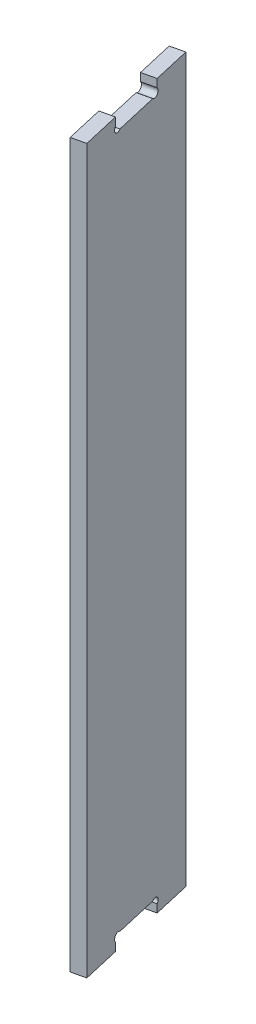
from build123d import *

# Parameters (mm, degrees)
SALIENTE_EXTRUIR1_DEPTH = 500
CROQUIS3_W              = 27.5
CROQUIS3_H              = 10
SALIENTE_EXTRUIR3_DEPTH = 10
CROQUIS4_R              = 3
CORTAR_EXTRUIR1_DEPTH   = 534.172633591


with BuildPart() as part:
    # Croquis2 → Saliente-Extruir1 (new body)
    with BuildSketch(Plane(origin=(0, 0, 0), x_dir=(1, 0, 0), z_dir=(0, 1, 0))):
        Polygon((390, 0), (411.361653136, -92.567163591), (401.617741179, -94.815758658), (380.256088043, -2.248595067), align=None)
    extrude(amount=SALIENTE_EXTRUIR1_DEPTH)

    # Croquis3 → Saliente-Extruir3 (add)
    with BuildSketch(Plane(origin=(360.536986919, 0, -83.200843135), x_dir=(0.22485950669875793, 0, 0.97439119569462), z_dir=(-0.97439119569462, 0, 0.22485950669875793))):
        with Locations((168.945207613, -5)):
            Rectangle(CROQUIS3_W, CROQUIS3_H)
        with Locations((101.445207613, -5)):
            Rectangle(CROQUIS3_W, CROQUIS3_H)
    saliente_extruir3 = extrude(amount=-SALIENTE_EXTRUIR3_DEPTH)

    # Croquis4 → Cortar-Extruir1 (cut, symmetric)
    with BuildSketch(Plane(origin=(360.536986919, 0, -83.200843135), x_dir=(0.22485950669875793, 0, 0.97439119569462), z_dir=(-0.97439119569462, 0, 0.22485950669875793))):
        with Locations((117.316527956, -2.121320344)):
            Circle(CROQUIS4_R)
        with Locations((153.073887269, -2.121320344)):
            Circle(CROQUIS4_R)
    cortar_extruir1 = extrude(amount=CORTAR_EXTRUIR1_DEPTH, both=True, mode=Mode.SUBTRACT)

    # Simetr_a3: Saliente-Extruir3, Cortar-Extruir1 across plane
    add(saliente_extruir3.mirror(Plane(origin=(0, 250, 0), x_dir=(0, 0, 1), z_dir=(0, -1, 0))))
    add(cortar_extruir1.mirror(Plane(origin=(0, 250, 0), x_dir=(0, 0, 1), z_dir=(0, -1, 0))), mode=Mode.SUBTRACT)


solid = part.part
